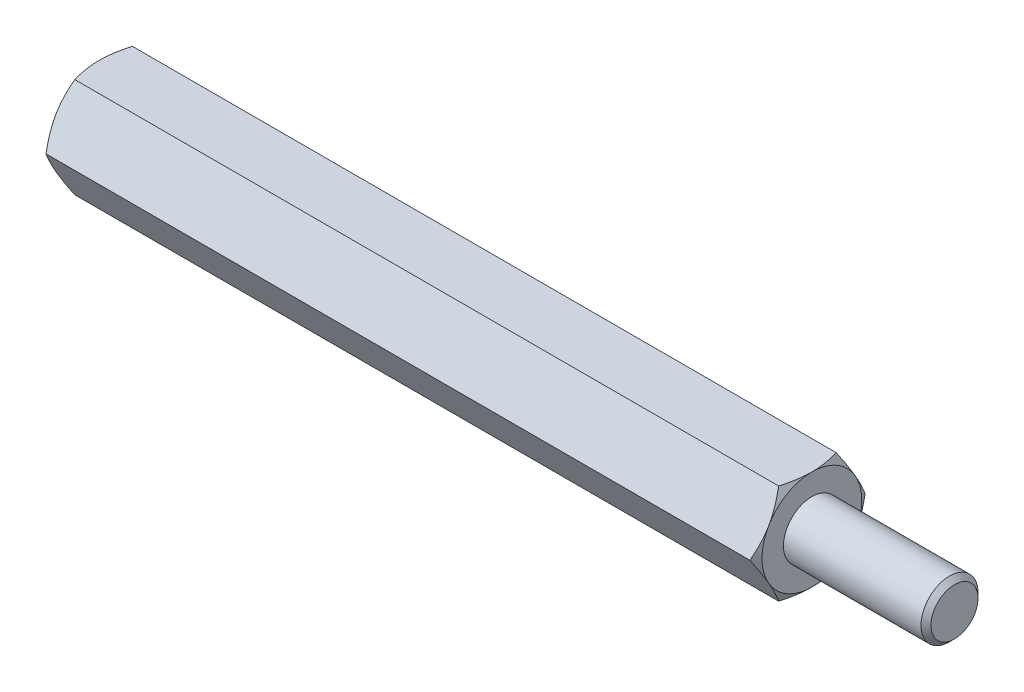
ISO-10303-21;
HEADER;
FILE_DESCRIPTION(('STEP AP214'),'2;1');
FILE_NAME('part.step','',(''),(''),'','','');
FILE_SCHEMA(('AUTOMOTIVE_DESIGN { 1 0 10303 214 1 1 1 1 }'));
ENDSEC;
DATA;
#1=APPLICATION_CONTEXT('core data for automotive mechanical design processes');
#2=APPLICATION_PROTOCOL_DEFINITION('international standard','automotive_design',2000,#1);
#3=PRODUCT_CONTEXT('',#1,'mechanical');
#4=PRODUCT('Part','Part','',(#3));
#5=PRODUCT_RELATED_PRODUCT_CATEGORY('part','',(#4));
#6=PRODUCT_DEFINITION_FORMATION('','',#4);
#7=PRODUCT_DEFINITION_CONTEXT('part definition',#1,'design');
#8=PRODUCT_DEFINITION('design','',#6,#7);
#9=PRODUCT_DEFINITION_SHAPE('','',#8);
#10=(LENGTH_UNIT() NAMED_UNIT(*) SI_UNIT(.MILLI.,.METRE.));
#11=(NAMED_UNIT(*) PLANE_ANGLE_UNIT() SI_UNIT($,.RADIAN.));
#12=(NAMED_UNIT(*) SI_UNIT($,.STERADIAN.) SOLID_ANGLE_UNIT());
#13=UNCERTAINTY_MEASURE_WITH_UNIT(LENGTH_MEASURE(1.E-05),#10,'distance_accuracy_value','');
#14=(GEOMETRIC_REPRESENTATION_CONTEXT(3) GLOBAL_UNCERTAINTY_ASSIGNED_CONTEXT((#13)) GLOBAL_UNIT_ASSIGNED_CONTEXT((#10,
#11,#12)) REPRESENTATION_CONTEXT('',''));
#15=CARTESIAN_POINT('',(0.,0.,0.));
#16=DIRECTION('',(0.,0.,1.));
#17=DIRECTION('',(1.,0.,0.));
#18=AXIS2_PLACEMENT_3D('',#15,#16,#17);
#19=CARTESIAN_POINT('',(25.,3.5,-2.02072594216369));
#20=DIRECTION('',(1.,0.,0.));
#21=DIRECTION('',(0.,0.,-1.));
#22=AXIS2_PLACEMENT_3D('',#19,#20,#21);
#23=PLANE('',#22);
#24=CARTESIAN_POINT('',(25.,0.,0.));
#25=DIRECTION('',(1.,0.,0.));
#26=DIRECTION('',(0.,0.,-1.));
#27=AXIS2_PLACEMENT_3D('',#24,#25,#26);
#28=CIRCLE('',#27,3.5);
#29=CARTESIAN_POINT('',(25.,-1.75,-3.03108891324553));
#30=VERTEX_POINT('',#29);
#31=CARTESIAN_POINT('',(25.,1.75,-3.03108891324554));
#32=VERTEX_POINT('',#31);
#33=EDGE_CURVE('E288',#30,#32,#28,.T.);
#34=ORIENTED_EDGE('',*,*,#33,.T.);
#35=CARTESIAN_POINT('',(25.,3.5,0.));
#36=VERTEX_POINT('',#35);
#37=EDGE_CURVE('E53',#32,#36,#28,.T.);
#38=ORIENTED_EDGE('',*,*,#37,.T.);
#39=CARTESIAN_POINT('',(25.,1.75,3.03108891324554));
#40=VERTEX_POINT('',#39);
#41=EDGE_CURVE('E297',#36,#40,#28,.T.);
#42=ORIENTED_EDGE('',*,*,#41,.T.);
#43=CARTESIAN_POINT('',(25.,-1.75000000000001,3.03108891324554));
#44=VERTEX_POINT('',#43);
#45=EDGE_CURVE('E302',#40,#44,#28,.T.);
#46=ORIENTED_EDGE('',*,*,#45,.T.);
#47=CARTESIAN_POINT('',(25.,0.,0.));
#48=DIRECTION('',(-1.,0.,0.));
#49=DIRECTION('',(0.,-1.,0.));
#50=AXIS2_PLACEMENT_3D('',#47,#48,#49);
#51=CIRCLE('',#50,3.5);
#52=CARTESIAN_POINT('',(25.,-3.50000000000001,0.));
#53=VERTEX_POINT('',#52);
#54=EDGE_CURVE('E193',#53,#44,#51,.T.);
#55=ORIENTED_EDGE('',*,*,#54,.F.);
#56=EDGE_CURVE('E61',#53,#30,#28,.T.);
#57=ORIENTED_EDGE('',*,*,#56,.T.);
#58=EDGE_LOOP('',(#34,#38,#42,#46,#55,#57));
#59=FACE_BOUND('',#58,.T.);
#60=CARTESIAN_POINT('',(25.,0.,0.));
#61=DIRECTION('',(1.,0.,0.));
#62=DIRECTION('',(0.,0.,-1.));
#63=AXIS2_PLACEMENT_3D('',#60,#61,#62);
#64=CIRCLE('',#63,2.);
#65=CARTESIAN_POINT('',(25.,0.,-2.));
#66=VERTEX_POINT('',#65);
#67=EDGE_CURVE('E314',#66,#66,#64,.T.);
#68=ORIENTED_EDGE('',*,*,#67,.F.);
#69=EDGE_LOOP('',(#68));
#70=FACE_BOUND('',#69,.T.);
#71=ADVANCED_FACE('F37',(#59,#70),#23,.T.);
#72=CARTESIAN_POINT('',(25.,0.,-4.04145188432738));
#73=DIRECTION('',(0.,-0.5,0.866025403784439));
#74=DIRECTION('',(0.,-0.866025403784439,-0.5));
#75=AXIS2_PLACEMENT_3D('',#72,#73,#74);
#76=PLANE('',#75);
#77=CARTESIAN_POINT('',(24.6873259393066,-0.000200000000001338,-4.04156735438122));
#78=CARTESIAN_POINT('',(24.73861421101,0.153607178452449,-3.9527667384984));
#79=CARTESIAN_POINT('',(24.7852590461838,0.308742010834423,-3.86319960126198));
#80=CARTESIAN_POINT('',(24.8666781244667,0.621698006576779,-3.68251437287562));
#81=CARTESIAN_POINT('',(24.9014235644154,0.779524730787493,-3.59139307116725));
#82=CARTESIAN_POINT('',(24.9555099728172,1.09322221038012,-3.41027974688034));
#83=CARTESIAN_POINT('',(24.9752109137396,1.24904469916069,-3.32031559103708));
#84=CARTESIAN_POINT('',(24.9987298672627,1.56142288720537,-3.13996396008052));
#85=CARTESIAN_POINT('',(25.0025673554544,1.71797745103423,-3.04957714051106));
#86=CARTESIAN_POINT('',(24.994584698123,2.01050921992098,-2.88068384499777));
#87=CARTESIAN_POINT('',(24.9847245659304,2.1465302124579,-2.80215208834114));
#88=CARTESIAN_POINT('',(24.9534735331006,2.41768602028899,-2.64560020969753));
#89=CARTESIAN_POINT('',(24.9320719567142,2.55281989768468,-2.5675806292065));
#90=CARTESIAN_POINT('',(24.8785695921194,2.82453479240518,-2.41070596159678));
#91=CARTESIAN_POINT('',(24.8462420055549,2.96108141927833,-2.33187072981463));
#92=CARTESIAN_POINT('',(24.772871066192,3.2321380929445,-2.17537608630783));
#93=CARTESIAN_POINT('',(24.7318449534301,3.36665161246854,-2.09771466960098));
#94=CARTESIAN_POINT('',(24.6873259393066,3.5002,-2.02061047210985));
#95=B_SPLINE_CURVE_WITH_KNOTS('',3,(#77,#78,#79,#80,#81,#82,#83,#84,#85,#86,#87,#88,#89,#90,#91,
#92,#93,#94),.UNSPECIFIED.,.F.,.F.,(4,2,2,2,2,2,2,2,4),(0.,0.554793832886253,1.11092123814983,
1.65328467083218,2.19498204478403,2.6666513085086,3.13875761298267,3.62133612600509,
4.10296698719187),.UNSPECIFIED.);
#96=CARTESIAN_POINT('',(24.6873926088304,0.,-4.04145188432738));
#97=VERTEX_POINT('',#96);
#98=EDGE_CURVE('E342',#97,#32,#95,.T.);
#99=ORIENTED_EDGE('',*,*,#98,.F.);
#100=DIRECTION('',(-1.,0.,0.));
#101=VECTOR('',#100,1.);
#102=CARTESIAN_POINT('',(25.,0.,-4.04145188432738));
#103=LINE('',#102,#101);
#104=CARTESIAN_POINT('',(-24.6873926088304,0.,-4.04145188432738));
#105=VERTEX_POINT('',#104);
#106=EDGE_CURVE('E264',#97,#105,#103,.T.);
#107=ORIENTED_EDGE('',*,*,#106,.T.);
#108=CARTESIAN_POINT('',(-24.6873259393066,3.5002,-2.02061047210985));
#109=CARTESIAN_POINT('',(-24.73861421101,3.34639282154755,-2.10941108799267));
#110=CARTESIAN_POINT('',(-24.7852590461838,3.19125798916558,-2.19897822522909));
#111=CARTESIAN_POINT('',(-24.8666781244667,2.87830199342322,-2.37966345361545));
#112=CARTESIAN_POINT('',(-24.9014235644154,2.72047526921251,-2.47078475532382));
#113=CARTESIAN_POINT('',(-24.9555099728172,2.40677778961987,-2.65189807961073));
#114=CARTESIAN_POINT('',(-24.9752109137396,2.25095530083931,-2.74186223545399));
#115=CARTESIAN_POINT('',(-24.9987298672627,1.93857711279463,-2.92221386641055));
#116=CARTESIAN_POINT('',(-25.0025673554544,1.78202254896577,-3.01260068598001));
#117=CARTESIAN_POINT('',(-24.994584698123,1.48949078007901,-3.1814939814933));
#118=CARTESIAN_POINT('',(-24.9847245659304,1.35346978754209,-3.26002573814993));
#119=CARTESIAN_POINT('',(-24.9534735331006,1.08231397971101,-3.41657761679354));
#120=CARTESIAN_POINT('',(-24.9320719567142,0.947180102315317,-3.49459719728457));
#121=CARTESIAN_POINT('',(-24.8785695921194,0.675465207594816,-3.65147186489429));
#122=CARTESIAN_POINT('',(-24.8462420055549,0.538918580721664,-3.73030709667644));
#123=CARTESIAN_POINT('',(-24.772871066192,0.267861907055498,-3.88680174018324));
#124=CARTESIAN_POINT('',(-24.7318449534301,0.133348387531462,-3.96446315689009));
#125=CARTESIAN_POINT('',(-24.6873259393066,-0.000200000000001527,-4.04156735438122));
#126=B_SPLINE_CURVE_WITH_KNOTS('',3,(#108,#109,#110,#111,#112,#113,#114,#115,#116,#117,#118,
#119,#120,#121,#122,#123,#124,#125),.UNSPECIFIED.,.F.,.F.,(4,2,2,2,2,2,2,2,4),(0.,
0.554793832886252,1.11092123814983,1.65328467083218,2.19498204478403,2.6666513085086,
3.13875761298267,3.6213361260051,4.10296698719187),.UNSPECIFIED.);
#127=CARTESIAN_POINT('',(-25.,1.75,-3.03108891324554));
#128=VERTEX_POINT('',#127);
#129=EDGE_CURVE('E336',#128,#105,#126,.T.);
#130=ORIENTED_EDGE('',*,*,#129,.F.);
#131=CARTESIAN_POINT('',(-24.6873926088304,3.5,-2.02072594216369));
#132=VERTEX_POINT('',#131);
#133=EDGE_CURVE('E333',#132,#128,#126,.T.);
#134=ORIENTED_EDGE('',*,*,#133,.F.);
#135=DIRECTION('',(-1.,0.,0.));
#136=VECTOR('',#135,1.);
#137=CARTESIAN_POINT('',(25.,3.5,-2.02072594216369));
#138=LINE('',#137,#136);
#139=CARTESIAN_POINT('',(24.6873926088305,3.5,-2.02072594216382));
#140=VERTEX_POINT('',#139);
#141=EDGE_CURVE('E279',#140,#132,#138,.T.);
#142=ORIENTED_EDGE('',*,*,#141,.F.);
#143=EDGE_CURVE('E229',#32,#140,#95,.T.);
#144=ORIENTED_EDGE('',*,*,#143,.F.);
#145=EDGE_LOOP('',(#99,#107,#130,#134,#142,#144));
#146=FACE_BOUND('',#145,.T.);
#147=ADVANCED_FACE('F148',(#146),#76,.F.);
#148=CARTESIAN_POINT('',(25.,3.5,-2.02072594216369));
#149=DIRECTION('',(0.,-1.,0.));
#150=DIRECTION('',(0.,0.,-1.));
#151=AXIS2_PLACEMENT_3D('',#148,#149,#150);
#152=PLANE('',#151);
#153=CARTESIAN_POINT('',(23.2443294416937,3.5,-5.525713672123));
#154=CARTESIAN_POINT('',(23.3192813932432,3.5,-5.37200190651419));
#155=CARTESIAN_POINT('',(23.3935424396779,3.5,-5.21794762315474));
#156=CARTESIAN_POINT('',(23.5402960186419,3.5,-4.90897223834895));
#157=CARTESIAN_POINT('',(23.6127882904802,3.5,-4.75405101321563));
#158=CARTESIAN_POINT('',(23.7559617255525,3.5,-4.44240758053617));
#159=CARTESIAN_POINT('',(23.8266316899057,3.5,-4.28568021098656));
#160=CARTESIAN_POINT('',(23.9652074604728,3.5,-3.97101270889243));
#161=CARTESIAN_POINT('',(24.0331133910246,3.5,-3.81307263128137));
#162=CARTESIAN_POINT('',(24.1677143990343,3.5,-3.49026114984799));
#163=CARTESIAN_POINT('',(24.2342871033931,3.5,-3.32533845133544));
#164=CARTESIAN_POINT('',(24.3626267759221,3.5,-2.99359992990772));
#165=CARTESIAN_POINT('',(24.4243932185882,3.5,-2.82678390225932));
#166=CARTESIAN_POINT('',(24.5415700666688,3.5,-2.49127529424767));
#167=CARTESIAN_POINT('',(24.5969925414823,3.5,-2.32258697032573));
#168=CARTESIAN_POINT('',(24.6997679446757,3.5,-1.98279215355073));
#169=CARTESIAN_POINT('',(24.7471233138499,3.5,-1.81168640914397));
#170=CARTESIAN_POINT('',(24.8312987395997,3.5,-1.46793354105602));
#171=CARTESIAN_POINT('',(24.8681796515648,3.5,-1.2953015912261));
#172=CARTESIAN_POINT('',(24.9293955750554,3.5,-0.947791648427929));
#173=CARTESIAN_POINT('',(24.953731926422,3.5,-0.772913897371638));
#174=CARTESIAN_POINT('',(24.9876038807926,3.5,-0.424108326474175));
#175=CARTESIAN_POINT('',(24.997337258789,3.5,-0.250200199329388));
#176=CARTESIAN_POINT('',(25.0017053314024,3.5,0.0978233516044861));
#177=CARTESIAN_POINT('',(24.9963399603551,3.5,0.271938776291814));
#178=CARTESIAN_POINT('',(24.9750118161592,3.5,0.56471127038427));
#179=CARTESIAN_POINT('',(24.9628919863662,3.5,0.683667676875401));
#180=CARTESIAN_POINT('',(24.9323080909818,3.5,0.920767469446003));
#181=CARTESIAN_POINT('',(24.9138432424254,3.5,1.03891075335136));
#182=CARTESIAN_POINT('',(24.8498956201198,3.5,1.39193174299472));
#183=CARTESIAN_POINT('',(24.7958695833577,3.5,1.62528232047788));
#184=CARTESIAN_POINT('',(24.7014515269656,3.5,1.97433825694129));
#185=CARTESIAN_POINT('',(24.6672900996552,3.5,2.09183268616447));
#186=CARTESIAN_POINT('',(24.595234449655,3.5,2.32568238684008));
#187=CARTESIAN_POINT('',(24.5573401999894,3.5,2.44203765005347));
#188=CARTESIAN_POINT('',(24.4784421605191,3.5,2.6736423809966));
#189=CARTESIAN_POINT('',(24.4374392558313,3.5,2.78889215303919));
#190=CARTESIAN_POINT('',(24.352824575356,3.5,3.01842460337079));
#191=CARTESIAN_POINT('',(24.3092128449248,3.5,3.1327072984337));
#192=CARTESIAN_POINT('',(24.1958241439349,3.5,3.42150510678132));
#193=CARTESIAN_POINT('',(24.1245636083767,3.5,3.59543696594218));
#194=CARTESIAN_POINT('',(23.9781026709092,3.5,3.94163961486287));
#195=CARTESIAN_POINT('',(23.9029019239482,3.5,4.11391025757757));
#196=CARTESIAN_POINT('',(23.7494252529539,3.5,4.45713072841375));
#197=CARTESIAN_POINT('',(23.6711484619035,3.5,4.62808016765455));
#198=CARTESIAN_POINT('',(23.512188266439,3.5,4.9688584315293));
#199=CARTESIAN_POINT('',(23.4315047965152,3.5,5.13868722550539));
#200=CARTESIAN_POINT('',(23.1863871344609,3.5,5.64726192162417));
#201=CARTESIAN_POINT('',(23.0190975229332,3.5,5.98463020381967));
#202=CARTESIAN_POINT('',(22.6795854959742,3.5,6.65678495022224));
#203=CARTESIAN_POINT('',(22.5073639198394,3.5,6.99157184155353));
#204=CARTESIAN_POINT('',(22.1760800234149,3.5,7.62749570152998));
#205=CARTESIAN_POINT('',(22.0173299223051,3.5,7.92879562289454));
#206=CARTESIAN_POINT('',(21.6977473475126,3.5,8.53030635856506));
#207=CARTESIAN_POINT('',(21.5369147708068,3.5,8.83051711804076));
#208=CARTESIAN_POINT('',(21.2141792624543,3.5,9.42918006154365));
#209=CARTESIAN_POINT('',(21.0522810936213,3.5,9.72763481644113));
#210=CARTESIAN_POINT('',(20.7272737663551,3.5,10.3238577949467));
#211=CARTESIAN_POINT('',(20.5641646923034,3.5,10.6216260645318));
#212=CARTESIAN_POINT('',(20.4006104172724,3.5,10.9191478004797));
#213=B_SPLINE_CURVE_WITH_KNOTS('',3,(#153,#154,#155,#156,#157,#158,#159,#160,#161,#162,#163,
#164,#165,#166,#167,#168,#169,#170,#171,#172,#173,#174,#175,#176,#177,#178,#179,#180,#181,#182,
#183,#184,#185,#186,#187,#188,#189,#190,#191,#192,#193,#194,#195,#196,#197,#198,#199,#200,#201,
#202,#203,#204,#205,#206,#207,#208,#209,#210,#211,#212),.UNSPECIFIED.,.F.,.F.,(4,2,2,2,2,2,2,2,
2,2,2,2,2,2,2,2,2,2,2,2,2,2,2,2,2,2,2,2,2,4),(0.,0.513041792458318,1.02615874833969,
1.54190801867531,2.05763406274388,2.59113284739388,3.1246898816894,3.65721433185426,
4.18957737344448,4.71878103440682,5.24792816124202,5.76984197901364,6.29175806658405,
6.6503025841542,7.00889136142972,7.72642330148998,8.0934692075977,8.46051776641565,
8.82746220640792,9.19440026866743,9.75822236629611,10.3220939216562,10.8861255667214,
11.4501725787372,12.579801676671,13.7092396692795,14.730918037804,15.7526471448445,
16.771258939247,17.7898004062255),.UNSPECIFIED.);
#214=EDGE_CURVE('E227',#140,#36,#213,.T.);
#215=ORIENTED_EDGE('',*,*,#214,.F.);
#216=ORIENTED_EDGE('',*,*,#141,.T.);
#217=CARTESIAN_POINT('',(-23.2443294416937,3.5,-5.525713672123));
#218=CARTESIAN_POINT('',(-23.3192813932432,3.5,-5.37200190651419));
#219=CARTESIAN_POINT('',(-23.3935424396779,3.5,-5.21794762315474));
#220=CARTESIAN_POINT('',(-23.5402960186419,3.5,-4.90897223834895));
#221=CARTESIAN_POINT('',(-23.6127882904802,3.5,-4.75405101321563));
#222=CARTESIAN_POINT('',(-23.7559617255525,3.5,-4.44240758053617));
#223=CARTESIAN_POINT('',(-23.8266316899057,3.5,-4.28568021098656));
#224=CARTESIAN_POINT('',(-23.9652074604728,3.5,-3.97101270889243));
#225=CARTESIAN_POINT('',(-24.0331133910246,3.5,-3.81307263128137));
#226=CARTESIAN_POINT('',(-24.1677143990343,3.5,-3.49026114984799));
#227=CARTESIAN_POINT('',(-24.2342871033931,3.5,-3.32533845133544));
#228=CARTESIAN_POINT('',(-24.3626267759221,3.5,-2.99359992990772));
#229=CARTESIAN_POINT('',(-24.4243932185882,3.5,-2.82678390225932));
#230=CARTESIAN_POINT('',(-24.5415700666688,3.5,-2.49127529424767));
#231=CARTESIAN_POINT('',(-24.5969925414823,3.5,-2.32258697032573));
#232=CARTESIAN_POINT('',(-24.6997679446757,3.5,-1.98279215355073));
#233=CARTESIAN_POINT('',(-24.7471233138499,3.5,-1.81168640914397));
#234=CARTESIAN_POINT('',(-24.8312987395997,3.5,-1.46793354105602));
#235=CARTESIAN_POINT('',(-24.8681796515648,3.5,-1.2953015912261));
#236=CARTESIAN_POINT('',(-24.9293955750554,3.5,-0.947791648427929));
#237=CARTESIAN_POINT('',(-24.953731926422,3.5,-0.772913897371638));
#238=CARTESIAN_POINT('',(-24.9876038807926,3.5,-0.424108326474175));
#239=CARTESIAN_POINT('',(-24.997337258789,3.5,-0.250200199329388));
#240=CARTESIAN_POINT('',(-25.0017053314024,3.5,0.0978233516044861));
#241=CARTESIAN_POINT('',(-24.9963399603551,3.5,0.271938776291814));
#242=CARTESIAN_POINT('',(-24.9750118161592,3.5,0.56471127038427));
#243=CARTESIAN_POINT('',(-24.9628919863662,3.5,0.683667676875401));
#244=CARTESIAN_POINT('',(-24.9323080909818,3.5,0.920767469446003));
#245=CARTESIAN_POINT('',(-24.9138432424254,3.5,1.03891075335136));
#246=CARTESIAN_POINT('',(-24.8498956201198,3.5,1.39193174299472));
#247=CARTESIAN_POINT('',(-24.7958695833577,3.5,1.62528232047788));
#248=CARTESIAN_POINT('',(-24.7014515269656,3.5,1.97433825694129));
#249=CARTESIAN_POINT('',(-24.6672900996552,3.5,2.09183268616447));
#250=CARTESIAN_POINT('',(-24.595234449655,3.5,2.32568238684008));
#251=CARTESIAN_POINT('',(-24.5573401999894,3.5,2.44203765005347));
#252=CARTESIAN_POINT('',(-24.4784421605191,3.5,2.6736423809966));
#253=CARTESIAN_POINT('',(-24.4374392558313,3.5,2.78889215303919));
#254=CARTESIAN_POINT('',(-24.352824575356,3.5,3.01842460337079));
#255=CARTESIAN_POINT('',(-24.3092128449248,3.5,3.1327072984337));
#256=CARTESIAN_POINT('',(-24.1958241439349,3.5,3.42150510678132));
#257=CARTESIAN_POINT('',(-24.1245636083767,3.5,3.59543696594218));
#258=CARTESIAN_POINT('',(-23.9781026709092,3.5,3.94163961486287));
#259=CARTESIAN_POINT('',(-23.9029019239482,3.5,4.11391025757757));
#260=CARTESIAN_POINT('',(-23.7494252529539,3.5,4.45713072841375));
#261=CARTESIAN_POINT('',(-23.6711484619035,3.5,4.62808016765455));
#262=CARTESIAN_POINT('',(-23.512188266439,3.5,4.9688584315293));
#263=CARTESIAN_POINT('',(-23.4315047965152,3.5,5.13868722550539));
#264=CARTESIAN_POINT('',(-23.1863871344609,3.5,5.64726192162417));
#265=CARTESIAN_POINT('',(-23.0190975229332,3.5,5.98463020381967));
#266=CARTESIAN_POINT('',(-22.6795854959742,3.5,6.65678495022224));
#267=CARTESIAN_POINT('',(-22.5073639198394,3.5,6.99157184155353));
#268=CARTESIAN_POINT('',(-22.1760800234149,3.5,7.62749570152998));
#269=CARTESIAN_POINT('',(-22.0173299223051,3.5,7.92879562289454));
#270=CARTESIAN_POINT('',(-21.6977473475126,3.5,8.53030635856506));
#271=CARTESIAN_POINT('',(-21.5369147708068,3.5,8.83051711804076));
#272=CARTESIAN_POINT('',(-21.2141792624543,3.5,9.42918006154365));
#273=CARTESIAN_POINT('',(-21.0522810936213,3.5,9.72763481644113));
#274=CARTESIAN_POINT('',(-20.7272737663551,3.5,10.3238577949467));
#275=CARTESIAN_POINT('',(-20.5641646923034,3.5,10.6216260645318));
#276=CARTESIAN_POINT('',(-20.4006104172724,3.5,10.9191478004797));
#277=B_SPLINE_CURVE_WITH_KNOTS('',3,(#217,#218,#219,#220,#221,#222,#223,#224,#225,#226,#227,
#228,#229,#230,#231,#232,#233,#234,#235,#236,#237,#238,#239,#240,#241,#242,#243,#244,#245,#246,
#247,#248,#249,#250,#251,#252,#253,#254,#255,#256,#257,#258,#259,#260,#261,#262,#263,#264,#265,
#266,#267,#268,#269,#270,#271,#272,#273,#274,#275,#276),.UNSPECIFIED.,.F.,.F.,(4,2,2,2,2,2,2,2,
2,2,2,2,2,2,2,2,2,2,2,2,2,2,2,2,2,2,2,2,2,4),(0.,0.513041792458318,1.02615874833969,
1.54190801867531,2.05763406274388,2.59113284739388,3.1246898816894,3.65721433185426,
4.18957737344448,4.71878103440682,5.24792816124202,5.76984197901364,6.29175806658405,
6.6503025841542,7.00889136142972,7.72642330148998,8.0934692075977,8.46051776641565,
8.82746220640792,9.19440026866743,9.75822236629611,10.3220939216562,10.8861255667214,
11.4501725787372,12.579801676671,13.7092396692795,14.730918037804,15.7526471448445,
16.771258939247,17.7898004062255),.UNSPECIFIED.);
#278=CARTESIAN_POINT('',(-25.,3.5,0.));
#279=VERTEX_POINT('',#278);
#280=EDGE_CURVE('E241',#279,#132,#277,.F.);
#281=ORIENTED_EDGE('',*,*,#280,.F.);
#282=CARTESIAN_POINT('',(-24.6873926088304,3.5,2.02072594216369));
#283=VERTEX_POINT('',#282);
#284=EDGE_CURVE('E249',#283,#279,#277,.F.);
#285=ORIENTED_EDGE('',*,*,#284,.F.);
#286=DIRECTION('',(-1.,0.,0.));
#287=VECTOR('',#286,1.);
#288=CARTESIAN_POINT('',(25.,3.5,2.02072594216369));
#289=LINE('',#288,#287);
#290=CARTESIAN_POINT('',(24.6873926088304,3.5,2.02072594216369));
#291=VERTEX_POINT('',#290);
#292=EDGE_CURVE('E276',#291,#283,#289,.T.);
#293=ORIENTED_EDGE('',*,*,#292,.F.);
#294=EDGE_CURVE('E221',#36,#291,#213,.T.);
#295=ORIENTED_EDGE('',*,*,#294,.F.);
#296=EDGE_LOOP('',(#215,#216,#281,#285,#293,#295));
#297=FACE_BOUND('',#296,.T.);
#298=ADVANCED_FACE('F153',(#297),#152,.F.);
#299=CARTESIAN_POINT('',(25.,3.5,2.02072594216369));
#300=DIRECTION('',(0.,-0.5,-0.866025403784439));
#301=DIRECTION('',(0.,0.866025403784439,-0.5));
#302=AXIS2_PLACEMENT_3D('',#299,#300,#301);
#303=PLANE('',#302);
#304=CARTESIAN_POINT('',(24.6873259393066,3.5002,2.02061047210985));
#305=CARTESIAN_POINT('',(24.73861421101,3.34639282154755,2.10941108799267));
#306=CARTESIAN_POINT('',(24.7852590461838,3.19125798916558,2.19897822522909));
#307=CARTESIAN_POINT('',(24.8666781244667,2.87830199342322,2.37966345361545));
#308=CARTESIAN_POINT('',(24.9014235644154,2.7204752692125,2.47078475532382));
#309=CARTESIAN_POINT('',(24.9555099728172,2.40677778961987,2.65189807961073));
#310=CARTESIAN_POINT('',(24.9752109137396,2.25095530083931,2.74186223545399));
#311=CARTESIAN_POINT('',(24.9987298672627,1.93857711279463,2.92221386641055));
#312=CARTESIAN_POINT('',(25.0025673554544,1.78202254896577,3.01260068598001));
#313=CARTESIAN_POINT('',(24.994584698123,1.48949078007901,3.1814939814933));
#314=CARTESIAN_POINT('',(24.9847245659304,1.35346978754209,3.26002573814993));
#315=CARTESIAN_POINT('',(24.9534735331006,1.08231397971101,3.41657761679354));
#316=CARTESIAN_POINT('',(24.9320719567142,0.947180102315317,3.49459719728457));
#317=CARTESIAN_POINT('',(24.8785695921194,0.675465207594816,3.65147186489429));
#318=CARTESIAN_POINT('',(24.8462420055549,0.538918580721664,3.73030709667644));
#319=CARTESIAN_POINT('',(24.772871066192,0.267861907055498,3.88680174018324));
#320=CARTESIAN_POINT('',(24.7318449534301,0.133348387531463,3.96446315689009));
#321=CARTESIAN_POINT('',(24.6873259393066,-0.000200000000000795,4.04156735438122));
#322=B_SPLINE_CURVE_WITH_KNOTS('',3,(#304,#305,#306,#307,#308,#309,#310,#311,#312,#313,#314,
#315,#316,#317,#318,#319,#320,#321),.UNSPECIFIED.,.F.,.F.,(4,2,2,2,2,2,2,2,4),(0.,
0.554793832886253,1.11092123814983,1.65328467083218,2.19498204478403,2.6666513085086,
3.13875761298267,3.62133612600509,4.10296698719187),.UNSPECIFIED.);
#323=EDGE_CURVE('E228',#291,#40,#322,.T.);
#324=ORIENTED_EDGE('',*,*,#323,.F.);
#325=ORIENTED_EDGE('',*,*,#292,.T.);
#326=CARTESIAN_POINT('',(-24.6873259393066,-0.000200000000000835,4.04156735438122));
#327=CARTESIAN_POINT('',(-24.73861421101,0.153607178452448,3.9527667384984));
#328=CARTESIAN_POINT('',(-24.7852590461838,0.308742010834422,3.86319960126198));
#329=CARTESIAN_POINT('',(-24.8666781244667,0.621698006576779,3.68251437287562));
#330=CARTESIAN_POINT('',(-24.9014235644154,0.779524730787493,3.59139307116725));
#331=CARTESIAN_POINT('',(-24.9555099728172,1.09322221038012,3.41027974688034));
#332=CARTESIAN_POINT('',(-24.9752109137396,1.24904469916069,3.32031559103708));
#333=CARTESIAN_POINT('',(-24.9987298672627,1.56142288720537,3.13996396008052));
#334=CARTESIAN_POINT('',(-25.0025673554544,1.71797745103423,3.04957714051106));
#335=CARTESIAN_POINT('',(-24.994584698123,2.01050921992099,2.88068384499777));
#336=CARTESIAN_POINT('',(-24.9847245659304,2.1465302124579,2.80215208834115));
#337=CARTESIAN_POINT('',(-24.9534735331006,2.41768602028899,2.64560020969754));
#338=CARTESIAN_POINT('',(-24.9320719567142,2.55281989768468,2.5675806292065));
#339=CARTESIAN_POINT('',(-24.8785695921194,2.82453479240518,2.41070596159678));
#340=CARTESIAN_POINT('',(-24.8462420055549,2.96108141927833,2.33187072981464));
#341=CARTESIAN_POINT('',(-24.772871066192,3.2321380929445,2.17537608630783));
#342=CARTESIAN_POINT('',(-24.7318449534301,3.36665161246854,2.09771466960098));
#343=CARTESIAN_POINT('',(-24.6873259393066,3.5002,2.02061047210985));
#344=B_SPLINE_CURVE_WITH_KNOTS('',3,(#326,#327,#328,#329,#330,#331,#332,#333,#334,#335,#336,
#337,#338,#339,#340,#341,#342,#343),.UNSPECIFIED.,.F.,.F.,(4,2,2,2,2,2,2,2,4),(0.,
0.554793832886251,1.11092123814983,1.65328467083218,2.19498204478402,2.66665130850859,
3.13875761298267,3.62133612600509,4.10296698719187),.UNSPECIFIED.);
#345=CARTESIAN_POINT('',(-25.,1.75,3.03108891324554));
#346=VERTEX_POINT('',#345);
#347=EDGE_CURVE('E255',#346,#283,#344,.T.);
#348=ORIENTED_EDGE('',*,*,#347,.F.);
#349=CARTESIAN_POINT('',(-24.6873926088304,0.,4.04145188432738));
#350=VERTEX_POINT('',#349);
#351=EDGE_CURVE('E262',#350,#346,#344,.T.);
#352=ORIENTED_EDGE('',*,*,#351,.F.);
#353=DIRECTION('',(-1.,0.,0.));
#354=VECTOR('',#353,1.);
#355=CARTESIAN_POINT('',(25.,0.,4.04145188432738));
#356=LINE('',#355,#354);
#357=CARTESIAN_POINT('',(24.6873926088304,0.,4.04145188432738));
#358=VERTEX_POINT('',#357);
#359=EDGE_CURVE('E273',#358,#350,#356,.T.);
#360=ORIENTED_EDGE('',*,*,#359,.F.);
#361=EDGE_CURVE('E215',#40,#358,#322,.T.);
#362=ORIENTED_EDGE('',*,*,#361,.F.);
#363=EDGE_LOOP('',(#324,#325,#348,#352,#360,#362));
#364=FACE_BOUND('',#363,.T.);
#365=ADVANCED_FACE('F235',(#364),#303,.F.);
#366=CARTESIAN_POINT('',(25.,0.,4.04145188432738));
#367=DIRECTION('',(0.,0.5,-0.866025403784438));
#368=DIRECTION('',(0.,0.866025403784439,0.5));
#369=AXIS2_PLACEMENT_3D('',#366,#367,#368);
#370=PLANE('',#369);
#371=CARTESIAN_POINT('',(24.6873259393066,0.000199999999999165,4.04156735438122));
#372=CARTESIAN_POINT('',(24.73861421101,-0.153607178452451,3.9527667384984));
#373=CARTESIAN_POINT('',(24.7852590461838,-0.308742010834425,3.86319960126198));
#374=CARTESIAN_POINT('',(24.8666781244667,-0.621698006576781,3.68251437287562));
#375=CARTESIAN_POINT('',(24.9014235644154,-0.779524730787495,3.59139307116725));
#376=CARTESIAN_POINT('',(24.9555099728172,-1.09322221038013,3.41027974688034));
#377=CARTESIAN_POINT('',(24.9752109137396,-1.24904469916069,3.32031559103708));
#378=CARTESIAN_POINT('',(24.9987298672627,-1.56142288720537,3.13996396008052));
#379=CARTESIAN_POINT('',(25.0025673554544,-1.71797745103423,3.04957714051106));
#380=CARTESIAN_POINT('',(24.994584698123,-2.01050921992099,2.88068384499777));
#381=CARTESIAN_POINT('',(24.9847245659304,-2.1465302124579,2.80215208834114));
#382=CARTESIAN_POINT('',(24.9534735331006,-2.41768602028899,2.64560020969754));
#383=CARTESIAN_POINT('',(24.9320719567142,-2.55281989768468,2.5675806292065));
#384=CARTESIAN_POINT('',(24.8785695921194,-2.82453479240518,2.41070596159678));
#385=CARTESIAN_POINT('',(24.8462420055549,-2.96108141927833,2.33187072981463));
#386=CARTESIAN_POINT('',(24.772871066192,-3.2321380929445,2.17537608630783));
#387=CARTESIAN_POINT('',(24.7318449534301,-3.36665161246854,2.09771466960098));
#388=CARTESIAN_POINT('',(24.6873259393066,-3.5002,2.02061047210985));
#389=B_SPLINE_CURVE_WITH_KNOTS('',3,(#371,#372,#373,#374,#375,#376,#377,#378,#379,#380,#381,
#382,#383,#384,#385,#386,#387,#388),.UNSPECIFIED.,.F.,.F.,(4,2,2,2,2,2,2,2,4),(0.,
0.554793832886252,1.11092123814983,1.65328467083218,2.19498204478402,2.66665130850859,
3.13875761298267,3.62133612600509,4.10296698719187),.UNSPECIFIED.);
#390=EDGE_CURVE('E331',#358,#44,#389,.T.);
#391=ORIENTED_EDGE('',*,*,#390,.F.);
#392=ORIENTED_EDGE('',*,*,#359,.T.);
#393=CARTESIAN_POINT('',(-24.6873259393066,-3.5002,2.02061047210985));
#394=CARTESIAN_POINT('',(-24.73861421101,-3.34639282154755,2.10941108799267));
#395=CARTESIAN_POINT('',(-24.7852590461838,-3.19125798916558,2.19897822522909));
#396=CARTESIAN_POINT('',(-24.8666781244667,-2.87830199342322,2.37966345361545));
#397=CARTESIAN_POINT('',(-24.9014235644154,-2.72047526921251,2.47078475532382));
#398=CARTESIAN_POINT('',(-24.9555099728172,-2.40677778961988,2.65189807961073));
#399=CARTESIAN_POINT('',(-24.9752109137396,-2.25095530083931,2.74186223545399));
#400=CARTESIAN_POINT('',(-24.9987298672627,-1.93857711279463,2.92221386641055));
#401=CARTESIAN_POINT('',(-25.0025673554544,-1.78202254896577,3.01260068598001));
#402=CARTESIAN_POINT('',(-24.994584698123,-1.48949078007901,3.1814939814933));
#403=CARTESIAN_POINT('',(-24.9847245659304,-1.3534697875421,3.26002573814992));
#404=CARTESIAN_POINT('',(-24.9534735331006,-1.08231397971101,3.41657761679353));
#405=CARTESIAN_POINT('',(-24.9320719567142,-0.94718010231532,3.49459719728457));
#406=CARTESIAN_POINT('',(-24.8785695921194,-0.675465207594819,3.65147186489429));
#407=CARTESIAN_POINT('',(-24.8462420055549,-0.538918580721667,3.73030709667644));
#408=CARTESIAN_POINT('',(-24.772871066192,-0.2678619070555,3.88680174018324));
#409=CARTESIAN_POINT('',(-24.7318449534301,-0.133348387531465,3.96446315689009));
#410=CARTESIAN_POINT('',(-24.6873259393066,0.000199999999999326,4.04156735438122));
#411=B_SPLINE_CURVE_WITH_KNOTS('',3,(#393,#394,#395,#396,#397,#398,#399,#400,#401,#402,#403,
#404,#405,#406,#407,#408,#409,#410),.UNSPECIFIED.,.F.,.F.,(4,2,2,2,2,2,2,2,4),(0.,
0.554793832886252,1.11092123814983,1.65328467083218,2.19498204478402,2.66665130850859,
3.13875761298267,3.62133612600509,4.10296698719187),.UNSPECIFIED.);
#412=CARTESIAN_POINT('',(-25.,-1.75000000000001,3.03108891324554));
#413=VERTEX_POINT('',#412);
#414=EDGE_CURVE('E263',#413,#350,#411,.T.);
#415=ORIENTED_EDGE('',*,*,#414,.F.);
#416=CARTESIAN_POINT('',(-24.6873926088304,-3.5,2.02072594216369));
#417=VERTEX_POINT('',#416);
#418=EDGE_CURVE('E250',#417,#413,#411,.T.);
#419=ORIENTED_EDGE('',*,*,#418,.F.);
#420=DIRECTION('',(-1.,0.,0.));
#421=VECTOR('',#420,1.);
#422=CARTESIAN_POINT('',(25.,-3.5,2.02072594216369));
#423=LINE('',#422,#421);
#424=CARTESIAN_POINT('',(24.6873926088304,-3.5,2.02072594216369));
#425=VERTEX_POINT('',#424);
#426=EDGE_CURVE('E270',#425,#417,#423,.T.);
#427=ORIENTED_EDGE('',*,*,#426,.F.);
#428=EDGE_CURVE('E210',#44,#425,#389,.T.);
#429=ORIENTED_EDGE('',*,*,#428,.F.);
#430=EDGE_LOOP('',(#391,#392,#415,#419,#427,#429));
#431=FACE_BOUND('',#430,.T.);
#432=ADVANCED_FACE('F357',(#431),#370,.F.);
#433=CARTESIAN_POINT('',(25.,-3.5,2.02072594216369));
#434=DIRECTION('',(0.,1.,0.));
#435=DIRECTION('',(0.,0.,1.));
#436=AXIS2_PLACEMENT_3D('',#433,#434,#435);
#437=PLANE('',#436);
#438=CARTESIAN_POINT('',(23.2443294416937,-3.5,-5.525713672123));
#439=CARTESIAN_POINT('',(23.3192813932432,-3.5,-5.37200190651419));
#440=CARTESIAN_POINT('',(23.3935424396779,-3.5,-5.21794762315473));
#441=CARTESIAN_POINT('',(23.5402960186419,-3.5,-4.90897223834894));
#442=CARTESIAN_POINT('',(23.6127882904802,-3.5,-4.75405101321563));
#443=CARTESIAN_POINT('',(23.7559617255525,-3.5,-4.44240758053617));
#444=CARTESIAN_POINT('',(23.8266316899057,-3.5,-4.28568021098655));
#445=CARTESIAN_POINT('',(23.9652074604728,-3.5,-3.97101270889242));
#446=CARTESIAN_POINT('',(24.0331133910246,-3.5,-3.81307263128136));
#447=CARTESIAN_POINT('',(24.1677143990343,-3.5,-3.49026114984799));
#448=CARTESIAN_POINT('',(24.2342871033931,-3.5,-3.32533845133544));
#449=CARTESIAN_POINT('',(24.3626267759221,-3.5,-2.99359992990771));
#450=CARTESIAN_POINT('',(24.4243932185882,-3.5,-2.82678390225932));
#451=CARTESIAN_POINT('',(24.5415700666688,-3.5,-2.49127529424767));
#452=CARTESIAN_POINT('',(24.5969925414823,-3.5,-2.32258697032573));
#453=CARTESIAN_POINT('',(24.6997679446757,-3.5,-1.98279215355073));
#454=CARTESIAN_POINT('',(24.7471233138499,-3.5,-1.81168640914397));
#455=CARTESIAN_POINT('',(24.8312987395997,-3.5,-1.46793354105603));
#456=CARTESIAN_POINT('',(24.8681796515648,-3.5,-1.2953015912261));
#457=CARTESIAN_POINT('',(24.9293955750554,-3.5,-0.947791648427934));
#458=CARTESIAN_POINT('',(24.953731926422,-3.5,-0.772913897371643));
#459=CARTESIAN_POINT('',(24.9876038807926,-3.5,-0.424108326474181));
#460=CARTESIAN_POINT('',(24.997337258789,-3.5,-0.250200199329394));
#461=CARTESIAN_POINT('',(25.0017053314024,-3.5,0.0978233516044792));
#462=CARTESIAN_POINT('',(24.9963399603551,-3.5,0.271938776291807));
#463=CARTESIAN_POINT('',(24.9750118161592,-3.5,0.564711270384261));
#464=CARTESIAN_POINT('',(24.9628919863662,-3.5,0.683667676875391));
#465=CARTESIAN_POINT('',(24.9323080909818,-3.5,0.920767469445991));
#466=CARTESIAN_POINT('',(24.9138432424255,-3.5,1.03891075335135));
#467=CARTESIAN_POINT('',(24.8498956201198,-3.5,1.3919317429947));
#468=CARTESIAN_POINT('',(24.7958695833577,-3.5,1.62528232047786));
#469=CARTESIAN_POINT('',(24.7014515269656,-3.5,1.97433825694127));
#470=CARTESIAN_POINT('',(24.6672900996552,-3.5,2.09183268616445));
#471=CARTESIAN_POINT('',(24.595234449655,-3.5,2.32568238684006));
#472=CARTESIAN_POINT('',(24.5573401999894,-3.5,2.44203765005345));
#473=CARTESIAN_POINT('',(24.4784421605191,-3.5,2.67364238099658));
#474=CARTESIAN_POINT('',(24.4374392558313,-3.5,2.78889215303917));
#475=CARTESIAN_POINT('',(24.352824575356,-3.5,3.01842460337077));
#476=CARTESIAN_POINT('',(24.3092128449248,-3.5,3.13270729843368));
#477=CARTESIAN_POINT('',(24.1958241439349,-3.5,3.4215051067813));
#478=CARTESIAN_POINT('',(24.1245636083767,-3.5,3.59543696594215));
#479=CARTESIAN_POINT('',(23.9781026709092,-3.5,3.94163961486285));
#480=CARTESIAN_POINT('',(23.9029019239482,-3.5,4.11391025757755));
#481=CARTESIAN_POINT('',(23.7494252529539,-3.5,4.45713072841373));
#482=CARTESIAN_POINT('',(23.6711484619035,-3.5,4.62808016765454));
#483=CARTESIAN_POINT('',(23.5121882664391,-3.5,4.96885843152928));
#484=CARTESIAN_POINT('',(23.4315047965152,-3.5,5.13868722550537));
#485=CARTESIAN_POINT('',(23.1863871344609,-3.5,5.64726192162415));
#486=CARTESIAN_POINT('',(23.0190975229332,-3.5,5.98463020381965));
#487=CARTESIAN_POINT('',(22.6795854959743,-3.5,6.65678495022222));
#488=CARTESIAN_POINT('',(22.5073639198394,-3.5,6.99157184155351));
#489=CARTESIAN_POINT('',(22.1760800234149,-3.5,7.62749570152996));
#490=CARTESIAN_POINT('',(22.0173299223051,-3.5,7.92879562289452));
#491=CARTESIAN_POINT('',(21.6977473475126,-3.5,8.53030635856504));
#492=CARTESIAN_POINT('',(21.5369147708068,-3.5,8.83051711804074));
#493=CARTESIAN_POINT('',(21.2141792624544,-3.5,9.42918006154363));
#494=CARTESIAN_POINT('',(21.0522810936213,-3.5,9.72763481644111));
#495=CARTESIAN_POINT('',(20.7272737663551,-3.5,10.3238577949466));
#496=CARTESIAN_POINT('',(20.5641646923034,-3.5,10.6216260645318));
#497=CARTESIAN_POINT('',(20.4006104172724,-3.5,10.9191478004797));
#498=B_SPLINE_CURVE_WITH_KNOTS('',3,(#438,#439,#440,#441,#442,#443,#444,#445,#446,#447,#448,
#449,#450,#451,#452,#453,#454,#455,#456,#457,#458,#459,#460,#461,#462,#463,#464,#465,#466,#467,
#468,#469,#470,#471,#472,#473,#474,#475,#476,#477,#478,#479,#480,#481,#482,#483,#484,#485,#486,
#487,#488,#489,#490,#491,#492,#493,#494,#495,#496,#497),.UNSPECIFIED.,.F.,.F.,(4,2,2,2,2,2,2,2,
2,2,2,2,2,2,2,2,2,2,2,2,2,2,2,2,2,2,2,2,2,4),(0.,0.513041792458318,1.02615874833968,
1.54190801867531,2.05763406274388,2.59113284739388,3.1246898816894,3.65721433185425,
4.18957737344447,4.71878103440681,5.247928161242,5.76984197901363,6.29175806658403,
6.65030258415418,7.0088913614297,7.72642330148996,8.09346920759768,8.46051776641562,
8.8274622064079,9.19440026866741,9.75822236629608,10.3220939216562,10.8861255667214,
11.4501725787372,12.579801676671,13.7092396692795,14.730918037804,15.7526471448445,
16.7712589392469,17.7898004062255),.UNSPECIFIED.);
#499=EDGE_CURVE('E332',#425,#53,#498,.F.);
#500=ORIENTED_EDGE('',*,*,#499,.F.);
#501=ORIENTED_EDGE('',*,*,#426,.T.);
#502=CARTESIAN_POINT('',(-23.2443294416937,-3.5,-5.525713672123));
#503=CARTESIAN_POINT('',(-23.3192813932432,-3.5,-5.37200190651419));
#504=CARTESIAN_POINT('',(-23.3935424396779,-3.5,-5.21794762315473));
#505=CARTESIAN_POINT('',(-23.5402960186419,-3.5,-4.90897223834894));
#506=CARTESIAN_POINT('',(-23.6127882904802,-3.5,-4.75405101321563));
#507=CARTESIAN_POINT('',(-23.7559617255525,-3.5,-4.44240758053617));
#508=CARTESIAN_POINT('',(-23.8266316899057,-3.5,-4.28568021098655));
#509=CARTESIAN_POINT('',(-23.9652074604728,-3.5,-3.97101270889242));
#510=CARTESIAN_POINT('',(-24.0331133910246,-3.5,-3.81307263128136));
#511=CARTESIAN_POINT('',(-24.1677143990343,-3.5,-3.49026114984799));
#512=CARTESIAN_POINT('',(-24.2342871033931,-3.5,-3.32533845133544));
#513=CARTESIAN_POINT('',(-24.3626267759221,-3.5,-2.99359992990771));
#514=CARTESIAN_POINT('',(-24.4243932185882,-3.5,-2.82678390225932));
#515=CARTESIAN_POINT('',(-24.5415700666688,-3.5,-2.49127529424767));
#516=CARTESIAN_POINT('',(-24.5969925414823,-3.5,-2.32258697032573));
#517=CARTESIAN_POINT('',(-24.6997679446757,-3.5,-1.98279215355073));
#518=CARTESIAN_POINT('',(-24.7471233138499,-3.5,-1.81168640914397));
#519=CARTESIAN_POINT('',(-24.8312987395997,-3.5,-1.46793354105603));
#520=CARTESIAN_POINT('',(-24.8681796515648,-3.5,-1.2953015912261));
#521=CARTESIAN_POINT('',(-24.9293955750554,-3.5,-0.947791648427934));
#522=CARTESIAN_POINT('',(-24.953731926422,-3.5,-0.772913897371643));
#523=CARTESIAN_POINT('',(-24.9876038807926,-3.5,-0.424108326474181));
#524=CARTESIAN_POINT('',(-24.997337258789,-3.5,-0.250200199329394));
#525=CARTESIAN_POINT('',(-25.0017053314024,-3.5,0.0978233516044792));
#526=CARTESIAN_POINT('',(-24.9963399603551,-3.5,0.271938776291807));
#527=CARTESIAN_POINT('',(-24.9750118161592,-3.5,0.564711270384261));
#528=CARTESIAN_POINT('',(-24.9628919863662,-3.5,0.683667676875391));
#529=CARTESIAN_POINT('',(-24.9323080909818,-3.5,0.920767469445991));
#530=CARTESIAN_POINT('',(-24.9138432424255,-3.5,1.03891075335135));
#531=CARTESIAN_POINT('',(-24.8498956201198,-3.5,1.3919317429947));
#532=CARTESIAN_POINT('',(-24.7958695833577,-3.5,1.62528232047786));
#533=CARTESIAN_POINT('',(-24.7014515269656,-3.5,1.97433825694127));
#534=CARTESIAN_POINT('',(-24.6672900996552,-3.5,2.09183268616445));
#535=CARTESIAN_POINT('',(-24.595234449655,-3.5,2.32568238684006));
#536=CARTESIAN_POINT('',(-24.5573401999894,-3.5,2.44203765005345));
#537=CARTESIAN_POINT('',(-24.4784421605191,-3.5,2.67364238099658));
#538=CARTESIAN_POINT('',(-24.4374392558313,-3.5,2.78889215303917));
#539=CARTESIAN_POINT('',(-24.352824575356,-3.5,3.01842460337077));
#540=CARTESIAN_POINT('',(-24.3092128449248,-3.5,3.13270729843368));
#541=CARTESIAN_POINT('',(-24.1958241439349,-3.5,3.4215051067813));
#542=CARTESIAN_POINT('',(-24.1245636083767,-3.5,3.59543696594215));
#543=CARTESIAN_POINT('',(-23.9781026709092,-3.5,3.94163961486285));
#544=CARTESIAN_POINT('',(-23.9029019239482,-3.5,4.11391025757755));
#545=CARTESIAN_POINT('',(-23.7494252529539,-3.5,4.45713072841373));
#546=CARTESIAN_POINT('',(-23.6711484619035,-3.5,4.62808016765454));
#547=CARTESIAN_POINT('',(-23.5121882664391,-3.5,4.96885843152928));
#548=CARTESIAN_POINT('',(-23.4315047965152,-3.5,5.13868722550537));
#549=CARTESIAN_POINT('',(-23.1863871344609,-3.5,5.64726192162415));
#550=CARTESIAN_POINT('',(-23.0190975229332,-3.5,5.98463020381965));
#551=CARTESIAN_POINT('',(-22.6795854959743,-3.5,6.65678495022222));
#552=CARTESIAN_POINT('',(-22.5073639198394,-3.5,6.99157184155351));
#553=CARTESIAN_POINT('',(-22.1760800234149,-3.5,7.62749570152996));
#554=CARTESIAN_POINT('',(-22.0173299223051,-3.5,7.92879562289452));
#555=CARTESIAN_POINT('',(-21.6977473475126,-3.5,8.53030635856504));
#556=CARTESIAN_POINT('',(-21.5369147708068,-3.5,8.83051711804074));
#557=CARTESIAN_POINT('',(-21.2141792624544,-3.5,9.42918006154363));
#558=CARTESIAN_POINT('',(-21.0522810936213,-3.5,9.72763481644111));
#559=CARTESIAN_POINT('',(-20.7272737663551,-3.5,10.3238577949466));
#560=CARTESIAN_POINT('',(-20.5641646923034,-3.5,10.6216260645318));
#561=CARTESIAN_POINT('',(-20.4006104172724,-3.5,10.9191478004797));
#562=B_SPLINE_CURVE_WITH_KNOTS('',3,(#502,#503,#504,#505,#506,#507,#508,#509,#510,#511,#512,
#513,#514,#515,#516,#517,#518,#519,#520,#521,#522,#523,#524,#525,#526,#527,#528,#529,#530,#531,
#532,#533,#534,#535,#536,#537,#538,#539,#540,#541,#542,#543,#544,#545,#546,#547,#548,#549,#550,
#551,#552,#553,#554,#555,#556,#557,#558,#559,#560,#561),.UNSPECIFIED.,.F.,.F.,(4,2,2,2,2,2,2,2,
2,2,2,2,2,2,2,2,2,2,2,2,2,2,2,2,2,2,2,2,2,4),(0.,0.513041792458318,1.02615874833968,
1.54190801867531,2.05763406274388,2.59113284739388,3.1246898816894,3.65721433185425,
4.18957737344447,4.71878103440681,5.247928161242,5.76984197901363,6.29175806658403,
6.65030258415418,7.0088913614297,7.72642330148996,8.09346920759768,8.46051776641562,
8.8274622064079,9.19440026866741,9.75822236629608,10.3220939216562,10.8861255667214,
11.4501725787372,12.579801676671,13.7092396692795,14.730918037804,15.7526471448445,
16.7712589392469,17.7898004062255),.UNSPECIFIED.);
#563=CARTESIAN_POINT('',(-25.,-3.50000000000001,0.));
#564=VERTEX_POINT('',#563);
#565=EDGE_CURVE('E335',#564,#417,#562,.T.);
#566=ORIENTED_EDGE('',*,*,#565,.F.);
#567=CARTESIAN_POINT('',(-24.6873926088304,-3.5,-2.02072594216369));
#568=VERTEX_POINT('',#567);
#569=EDGE_CURVE('E394',#568,#564,#562,.T.);
#570=ORIENTED_EDGE('',*,*,#569,.F.);
#571=DIRECTION('',(-1.,0.,0.));
#572=VECTOR('',#571,1.);
#573=CARTESIAN_POINT('',(25.,-3.5,-2.02072594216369));
#574=LINE('',#573,#572);
#575=CARTESIAN_POINT('',(24.6873926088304,-3.5,-2.02072594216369));
#576=VERTEX_POINT('',#575);
#577=EDGE_CURVE('E267',#576,#568,#574,.T.);
#578=ORIENTED_EDGE('',*,*,#577,.F.);
#579=EDGE_CURVE('E195',#53,#576,#498,.F.);
#580=ORIENTED_EDGE('',*,*,#579,.F.);
#581=EDGE_LOOP('',(#500,#501,#566,#570,#578,#580));
#582=FACE_BOUND('',#581,.T.);
#583=ADVANCED_FACE('F172',(#582),#437,.F.);
#584=CARTESIAN_POINT('',(25.,-3.5,-2.02072594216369));
#585=DIRECTION('',(0.,0.5,0.866025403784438));
#586=DIRECTION('',(0.,-0.866025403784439,0.5));
#587=AXIS2_PLACEMENT_3D('',#584,#585,#586);
#588=PLANE('',#587);
#589=CARTESIAN_POINT('',(24.6873259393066,-3.5002,-2.02061047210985));
#590=CARTESIAN_POINT('',(24.73861421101,-3.34639282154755,-2.10941108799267));
#591=CARTESIAN_POINT('',(24.7852590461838,-3.19125798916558,-2.19897822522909));
#592=CARTESIAN_POINT('',(24.8666781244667,-2.87830199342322,-2.37966345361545));
#593=CARTESIAN_POINT('',(24.9014235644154,-2.72047526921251,-2.47078475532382));
#594=CARTESIAN_POINT('',(24.9555099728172,-2.40677778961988,-2.65189807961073));
#595=CARTESIAN_POINT('',(24.9752109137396,-2.25095530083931,-2.74186223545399));
#596=CARTESIAN_POINT('',(24.9987298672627,-1.93857711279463,-2.92221386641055));
#597=CARTESIAN_POINT('',(25.0025673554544,-1.78202254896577,-3.01260068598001));
#598=CARTESIAN_POINT('',(24.994584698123,-1.48949078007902,-3.1814939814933));
#599=CARTESIAN_POINT('',(24.9847245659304,-1.3534697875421,-3.26002573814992));
#600=CARTESIAN_POINT('',(24.9534735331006,-1.08231397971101,-3.41657761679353));
#601=CARTESIAN_POINT('',(24.9320719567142,-0.947180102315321,-3.49459719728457));
#602=CARTESIAN_POINT('',(24.8785695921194,-0.675465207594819,-3.65147186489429));
#603=CARTESIAN_POINT('',(24.8462420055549,-0.538918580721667,-3.73030709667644));
#604=CARTESIAN_POINT('',(24.772871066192,-0.2678619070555,-3.88680174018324));
#605=CARTESIAN_POINT('',(24.7318449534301,-0.133348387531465,-3.96446315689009));
#606=CARTESIAN_POINT('',(24.6873259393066,0.000199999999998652,-4.04156735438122));
#607=B_SPLINE_CURVE_WITH_KNOTS('',3,(#589,#590,#591,#592,#593,#594,#595,#596,#597,#598,#599,
#600,#601,#602,#603,#604,#605,#606),.UNSPECIFIED.,.F.,.F.,(4,2,2,2,2,2,2,2,4),(0.,
0.554793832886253,1.11092123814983,1.65328467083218,2.19498204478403,2.66665130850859,
3.13875761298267,3.62133612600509,4.10296698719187),.UNSPECIFIED.);
#608=EDGE_CURVE('E192',#576,#30,#607,.T.);
#609=ORIENTED_EDGE('',*,*,#608,.F.);
#610=ORIENTED_EDGE('',*,*,#577,.T.);
#611=CARTESIAN_POINT('',(-24.6873259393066,0.000199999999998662,-4.04156735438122));
#612=CARTESIAN_POINT('',(-24.73861421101,-0.153607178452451,-3.9527667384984));
#613=CARTESIAN_POINT('',(-24.7852590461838,-0.308742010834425,-3.86319960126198));
#614=CARTESIAN_POINT('',(-24.8666781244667,-0.621698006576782,-3.68251437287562));
#615=CARTESIAN_POINT('',(-24.9014235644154,-0.779524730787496,-3.59139307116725));
#616=CARTESIAN_POINT('',(-24.9555099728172,-1.09322221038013,-3.41027974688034));
#617=CARTESIAN_POINT('',(-24.9752109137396,-1.24904469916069,-3.32031559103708));
#618=CARTESIAN_POINT('',(-24.9987298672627,-1.56142288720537,-3.13996396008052));
#619=CARTESIAN_POINT('',(-25.0025673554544,-1.71797745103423,-3.04957714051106));
#620=CARTESIAN_POINT('',(-24.994584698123,-2.01050921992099,-2.88068384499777));
#621=CARTESIAN_POINT('',(-24.9847245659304,-2.14653021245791,-2.80215208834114));
#622=CARTESIAN_POINT('',(-24.9534735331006,-2.41768602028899,-2.64560020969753));
#623=CARTESIAN_POINT('',(-24.9320719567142,-2.55281989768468,-2.5675806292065));
#624=CARTESIAN_POINT('',(-24.8785695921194,-2.82453479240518,-2.41070596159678));
#625=CARTESIAN_POINT('',(-24.8462420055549,-2.96108141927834,-2.33187072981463));
#626=CARTESIAN_POINT('',(-24.772871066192,-3.2321380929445,-2.17537608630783));
#627=CARTESIAN_POINT('',(-24.7318449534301,-3.36665161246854,-2.09771466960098));
#628=CARTESIAN_POINT('',(-24.6873259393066,-3.5002,-2.02061047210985));
#629=B_SPLINE_CURVE_WITH_KNOTS('',3,(#611,#612,#613,#614,#615,#616,#617,#618,#619,#620,#621,
#622,#623,#624,#625,#626,#627,#628),.UNSPECIFIED.,.F.,.F.,(4,2,2,2,2,2,2,2,4),(0.,
0.554793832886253,1.11092123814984,1.65328467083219,2.19498204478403,2.6666513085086,
3.13875761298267,3.62133612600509,4.10296698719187),.UNSPECIFIED.);
#630=CARTESIAN_POINT('',(-25.,-1.75,-3.03108891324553));
#631=VERTEX_POINT('',#630);
#632=EDGE_CURVE('E178',#631,#568,#629,.T.);
#633=ORIENTED_EDGE('',*,*,#632,.F.);
#634=EDGE_CURVE('E347',#105,#631,#629,.T.);
#635=ORIENTED_EDGE('',*,*,#634,.F.);
#636=ORIENTED_EDGE('',*,*,#106,.F.);
#637=EDGE_CURVE('E185',#30,#97,#607,.T.);
#638=ORIENTED_EDGE('',*,*,#637,.F.);
#639=EDGE_LOOP('',(#609,#610,#633,#635,#636,#638));
#640=FACE_BOUND('',#639,.T.);
#641=ADVANCED_FACE('F167',(#640),#588,.F.);
#642=CARTESIAN_POINT('',(-25.,0.,0.));
#643=DIRECTION('',(1.,0.,0.));
#644=DIRECTION('',(0.,1.,0.));
#645=AXIS2_PLACEMENT_3D('',#642,#643,#644);
#646=CONICAL_SURFACE('',#645,3.5,1.0471975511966);
#647=ORIENTED_EDGE('',*,*,#129,.T.);
#648=ORIENTED_EDGE('',*,*,#634,.T.);
#649=CARTESIAN_POINT('',(-25.,0.,0.));
#650=DIRECTION('',(1.,0.,0.));
#651=DIRECTION('',(0.,0.,-1.));
#652=AXIS2_PLACEMENT_3D('',#649,#650,#651);
#653=CIRCLE('',#652,3.5);
#654=EDGE_CURVE('E282',#631,#128,#653,.T.);
#655=ORIENTED_EDGE('',*,*,#654,.T.);
#656=EDGE_LOOP('',(#647,#648,#655));
#657=FACE_BOUND('',#656,.T.);
#658=ADVANCED_FACE('F171',(#657),#646,.T.);
#659=ORIENTED_EDGE('',*,*,#569,.T.);
#660=EDGE_CURVE('E286',#564,#631,#653,.T.);
#661=ORIENTED_EDGE('',*,*,#660,.T.);
#662=ORIENTED_EDGE('',*,*,#632,.T.);
#663=EDGE_LOOP('',(#659,#661,#662));
#664=FACE_BOUND('',#663,.T.);
#665=ADVANCED_FACE('F392',(#664),#646,.T.);
#666=ORIENTED_EDGE('',*,*,#418,.T.);
#667=CARTESIAN_POINT('',(-25.,0.,0.));
#668=DIRECTION('',(-1.,0.,0.));
#669=DIRECTION('',(0.,-1.,0.));
#670=AXIS2_PLACEMENT_3D('',#667,#668,#669);
#671=CIRCLE('',#670,3.5);
#672=EDGE_CURVE('E339',#564,#413,#671,.T.);
#673=ORIENTED_EDGE('',*,*,#672,.F.);
#674=ORIENTED_EDGE('',*,*,#565,.T.);
#675=EDGE_LOOP('',(#666,#673,#674));
#676=FACE_BOUND('',#675,.T.);
#677=ADVANCED_FACE('F414',(#676),#646,.T.);
#678=ORIENTED_EDGE('',*,*,#351,.T.);
#679=EDGE_CURVE('E349',#346,#413,#653,.T.);
#680=ORIENTED_EDGE('',*,*,#679,.T.);
#681=ORIENTED_EDGE('',*,*,#414,.T.);
#682=EDGE_LOOP('',(#678,#680,#681));
#683=FACE_BOUND('',#682,.T.);
#684=ADVANCED_FACE('F158',(#683),#646,.T.);
#685=ORIENTED_EDGE('',*,*,#347,.T.);
#686=ORIENTED_EDGE('',*,*,#284,.T.);
#687=EDGE_CURVE('E351',#279,#346,#653,.T.);
#688=ORIENTED_EDGE('',*,*,#687,.T.);
#689=EDGE_LOOP('',(#685,#686,#688));
#690=FACE_BOUND('',#689,.T.);
#691=ADVANCED_FACE('F377',(#690),#646,.T.);
#692=ORIENTED_EDGE('',*,*,#280,.T.);
#693=ORIENTED_EDGE('',*,*,#133,.T.);
#694=EDGE_CURVE('E287',#128,#279,#653,.T.);
#695=ORIENTED_EDGE('',*,*,#694,.T.);
#696=EDGE_LOOP('',(#692,#693,#695));
#697=FACE_BOUND('',#696,.T.);
#698=ADVANCED_FACE('F165',(#697),#646,.T.);
#699=CARTESIAN_POINT('',(-25.,3.5,-2.02072594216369));
#700=DIRECTION('',(1.,0.,0.));
#701=DIRECTION('',(0.,0.,-1.));
#702=AXIS2_PLACEMENT_3D('',#699,#700,#701);
#703=PLANE('',#702);
#704=CARTESIAN_POINT('',(-25.,0.,0.));
#705=DIRECTION('',(-1.,0.,0.));
#706=DIRECTION('',(0.,0.,1.));
#707=AXIS2_PLACEMENT_3D('',#704,#705,#706);
#708=CIRCLE('',#707,1.65);
#709=CARTESIAN_POINT('',(-25.,0.,1.65));
#710=VERTEX_POINT('',#709);
#711=EDGE_CURVE('E316',#710,#710,#708,.T.);
#712=ORIENTED_EDGE('',*,*,#711,.F.);
#713=EDGE_LOOP('',(#712));
#714=FACE_BOUND('',#713,.T.);
#715=ORIENTED_EDGE('',*,*,#694,.F.);
#716=ORIENTED_EDGE('',*,*,#654,.F.);
#717=ORIENTED_EDGE('',*,*,#660,.F.);
#718=ORIENTED_EDGE('',*,*,#672,.T.);
#719=ORIENTED_EDGE('',*,*,#679,.F.);
#720=ORIENTED_EDGE('',*,*,#687,.F.);
#721=EDGE_LOOP('',(#715,#716,#717,#718,#719,#720));
#722=FACE_BOUND('',#721,.T.);
#723=ADVANCED_FACE('F161',(#714,#722),#703,.F.);
#724=CARTESIAN_POINT('',(25.,0.,0.));
#725=DIRECTION('',(-1.,0.,0.));
#726=DIRECTION('',(0.,1.,0.));
#727=AXIS2_PLACEMENT_3D('',#724,#725,#726);
#728=CONICAL_SURFACE('',#727,3.5,1.0471975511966);
#729=ORIENTED_EDGE('',*,*,#98,.T.);
#730=ORIENTED_EDGE('',*,*,#33,.F.);
#731=ORIENTED_EDGE('',*,*,#637,.T.);
#732=EDGE_LOOP('',(#729,#730,#731));
#733=FACE_BOUND('',#732,.T.);
#734=ADVANCED_FACE('F164',(#733),#728,.T.);
#735=ORIENTED_EDGE('',*,*,#579,.T.);
#736=ORIENTED_EDGE('',*,*,#608,.T.);
#737=ORIENTED_EDGE('',*,*,#56,.F.);
#738=EDGE_LOOP('',(#735,#736,#737));
#739=FACE_BOUND('',#738,.T.);
#740=ADVANCED_FACE('F202',(#739),#728,.T.);
#741=ORIENTED_EDGE('',*,*,#428,.T.);
#742=ORIENTED_EDGE('',*,*,#499,.T.);
#743=ORIENTED_EDGE('',*,*,#54,.T.);
#744=EDGE_LOOP('',(#741,#742,#743));
#745=FACE_BOUND('',#744,.T.);
#746=ADVANCED_FACE('F415',(#745),#728,.T.);
#747=ORIENTED_EDGE('',*,*,#361,.T.);
#748=ORIENTED_EDGE('',*,*,#390,.T.);
#749=ORIENTED_EDGE('',*,*,#45,.F.);
#750=EDGE_LOOP('',(#747,#748,#749));
#751=FACE_BOUND('',#750,.T.);
#752=ADVANCED_FACE('F354',(#751),#728,.T.);
#753=ORIENTED_EDGE('',*,*,#294,.T.);
#754=ORIENTED_EDGE('',*,*,#323,.T.);
#755=ORIENTED_EDGE('',*,*,#41,.F.);
#756=EDGE_LOOP('',(#753,#754,#755));
#757=FACE_BOUND('',#756,.T.);
#758=ADVANCED_FACE('F424',(#757),#728,.T.);
#759=ORIENTED_EDGE('',*,*,#143,.T.);
#760=ORIENTED_EDGE('',*,*,#214,.T.);
#761=ORIENTED_EDGE('',*,*,#37,.F.);
#762=EDGE_LOOP('',(#759,#760,#761));
#763=FACE_BOUND('',#762,.T.);
#764=ADVANCED_FACE('F143',(#763),#728,.T.);
#765=CARTESIAN_POINT('',(-15.,0.,0.));
#766=DIRECTION('',(-1.,0.,0.));
#767=DIRECTION('',(0.,0.,1.));
#768=AXIS2_PLACEMENT_3D('',#765,#766,#767);
#769=CYLINDRICAL_SURFACE('',#768,1.65);
#770=CARTESIAN_POINT('',(-15.,0.,0.));
#771=DIRECTION('',(1.,0.,0.));
#772=DIRECTION('',(0.,0.,-1.));
#773=AXIS2_PLACEMENT_3D('',#770,#771,#772);
#774=CIRCLE('',#773,1.65);
#775=CARTESIAN_POINT('',(-15.,0.,-1.65));
#776=VERTEX_POINT('',#775);
#777=EDGE_CURVE('E319',#776,#776,#774,.T.);
#778=ORIENTED_EDGE('',*,*,#777,.T.);
#779=EDGE_LOOP('',(#778));
#780=FACE_BOUND('',#779,.T.);
#781=ORIENTED_EDGE('',*,*,#711,.T.);
#782=EDGE_LOOP('',(#781));
#783=FACE_BOUND('',#782,.T.);
#784=ADVANCED_FACE('F133',(#780,#783),#769,.F.);
#785=CARTESIAN_POINT('',(-14.0473720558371,0.,0.));
#786=DIRECTION('',(-1.,0.,0.));
#787=DIRECTION('',(0.,0.,1.));
#788=AXIS2_PLACEMENT_3D('',#785,#786,#787);
#789=CONICAL_SURFACE('',#788,0.,1.0471975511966);
#790=ORIENTED_EDGE('',*,*,#777,.F.);
#791=EDGE_LOOP('',(#790));
#792=FACE_BOUND('',#791,.T.);
#793=CARTESIAN_POINT('',(-14.0473720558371,0.,0.));
#794=VERTEX_POINT('',#793);
#795=VERTEX_LOOP('',#794);
#796=FACE_BOUND('',#795,.T.);
#797=ADVANCED_FACE('F130',(#792,#796),#789,.F.);
#798=CARTESIAN_POINT('',(35.,0.,0.));
#799=DIRECTION('',(-1.,0.,0.));
#800=DIRECTION('',(0.,0.,1.));
#801=AXIS2_PLACEMENT_3D('',#798,#799,#800);
#802=CYLINDRICAL_SURFACE('',#801,2.);
#803=CARTESIAN_POINT('',(34.65,0.,0.));
#804=DIRECTION('',(1.,0.,0.));
#805=DIRECTION('',(0.,0.,-1.));
#806=AXIS2_PLACEMENT_3D('',#803,#804,#805);
#807=CIRCLE('',#806,2.);
#808=CARTESIAN_POINT('',(34.65,0.,-2.));
#809=VERTEX_POINT('',#808);
#810=EDGE_CURVE('E11',#809,#809,#807,.F.);
#811=ORIENTED_EDGE('',*,*,#810,.T.);
#812=EDGE_LOOP('',(#811));
#813=FACE_BOUND('',#812,.T.);
#814=ORIENTED_EDGE('',*,*,#67,.T.);
#815=EDGE_LOOP('',(#814));
#816=FACE_BOUND('',#815,.T.);
#817=ADVANCED_FACE('F132',(#813,#816),#802,.T.);
#818=CARTESIAN_POINT('',(35.,0.,0.));
#819=DIRECTION('',(1.,0.,0.));
#820=DIRECTION('',(0.,0.,-1.));
#821=AXIS2_PLACEMENT_3D('',#818,#819,#820);
#822=PLANE('',#821);
#823=CARTESIAN_POINT('',(35.,0.,0.));
#824=DIRECTION('',(1.,0.,0.));
#825=DIRECTION('',(0.,0.,-1.));
#826=AXIS2_PLACEMENT_3D('',#823,#824,#825);
#827=CIRCLE('',#826,1.65000000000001);
#828=CARTESIAN_POINT('',(35.,0.,-1.65000000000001));
#829=VERTEX_POINT('',#828);
#830=EDGE_CURVE('E46',#829,#829,#827,.T.);
#831=ORIENTED_EDGE('',*,*,#830,.T.);
#832=EDGE_LOOP('',(#831));
#833=FACE_BOUND('',#832,.T.);
#834=ADVANCED_FACE('F140',(#833),#822,.T.);
#835=CARTESIAN_POINT('',(35.,0.,0.));
#836=DIRECTION('',(-1.,0.,0.));
#837=DIRECTION('',(0.,0.,1.));
#838=AXIS2_PLACEMENT_3D('',#835,#836,#837);
#839=CONICAL_SURFACE('',#838,1.65000000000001,0.785398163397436);
#840=ORIENTED_EDGE('',*,*,#810,.F.);
#841=EDGE_LOOP('',(#840));
#842=FACE_BOUND('',#841,.T.);
#843=ORIENTED_EDGE('',*,*,#830,.F.);
#844=EDGE_LOOP('',(#843));
#845=FACE_BOUND('',#844,.T.);
#846=ADVANCED_FACE('F39',(#842,#845),#839,.T.);
#847=CLOSED_SHELL('',(#71,#147,#298,#365,#432,#583,#641,#658,#665,#677,#684,#691,#698,#723,#734,
#740,#746,#752,#758,#764,#784,#797,#817,#834,#846));
#848=MANIFOLD_SOLID_BREP('B2',#847);
#849=ADVANCED_BREP_SHAPE_REPRESENTATION('',(#18,#848),#14);
#850=SHAPE_DEFINITION_REPRESENTATION(#9,#849);
ENDSEC;
END-ISO-10303-21;
